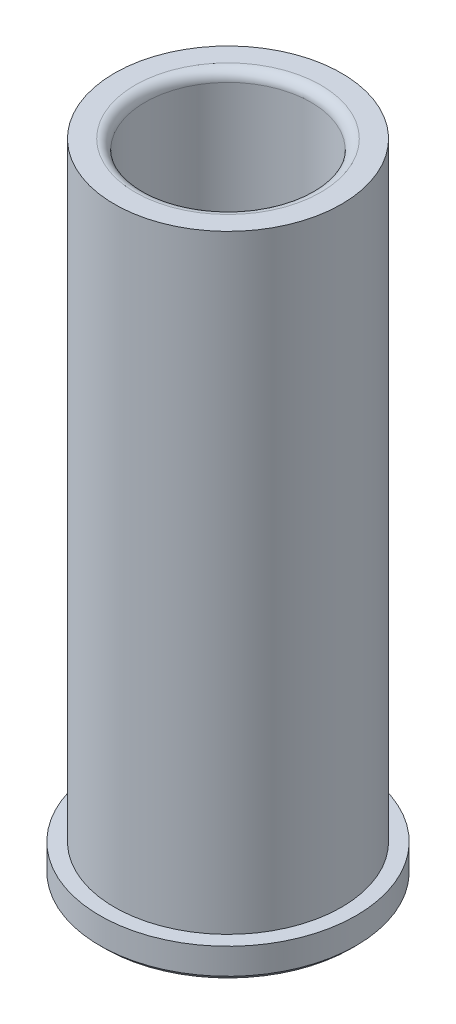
from build123d import *

# Parameters (mm, degrees)
FILLET1_R = 1.524


with BuildPart() as part:
    # Sketch1 → Revolve1 (revolve)
    with BuildSketch(Plane.XY, mode=Mode.PRIVATE) as revolve1_sk:
        Polygon((-18.9484, 0), (-19.7104, 0.762), (-19.7104, 4.7625), (-17.46885, 4.7625), (-17.46885, 98.425), (-12.7635, 98.425), (-12.7635, 0.762), (-13.5255, 0), align=None)
    revolve(revolve1_sk.sketch.rotate(Axis((0, -1000, 0), (0, 1, 0)), 180), axis=Axis((0, -1000, 0), (0, 1, 0)))

    # Fillet1
    fillet1_edges = [part.edges().sort_by_distance(p)[0] for p in [
        (-12.7635, 98.425, 0),
    ]]
    fillet(fillet1_edges, radius=FILLET1_R)


solid = part.part
